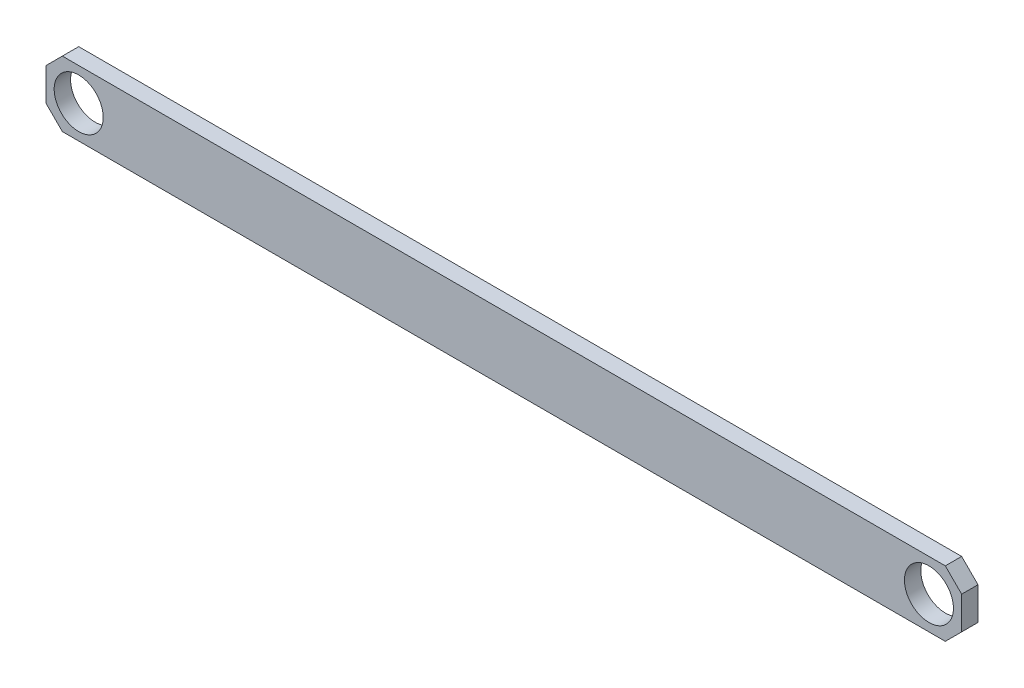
from build123d import *

# Parameters (mm, degrees)
SKETCH1_W          = 177.8
SKETCH1_H          = 12.7
SKETCH1_R          = 4.7625
BASE_EXTRUDE_DEPTH = 3.175
CHAMFER1_SIZE      = 3.175


with BuildPart() as part:
    # Sketch1 → Base-Extrude (new body)
    with BuildSketch(Plane.XY):
        with Locations((88.9, 6.35)):
            Rectangle(SKETCH1_W, SKETCH1_H)
        with Locations((6.35, 6.35)):
            Circle(SKETCH1_R, mode=Mode.SUBTRACT)
        with Locations(Location((171.45, 6.35, 0), (0, 0, 180))):
            Circle(SKETCH1_R, mode=Mode.SUBTRACT)
    extrude(amount=BASE_EXTRUDE_DEPTH)

    # Chamfer1
    chamfer1_edges = [part.edges().sort_by_distance(p)[0] for p in [
        (0, 12.7, 1.5875),
        (177.8, 12.7, 1.5875),
        (177.8, 0, 1.5875),
        (0, 0, 1.5875),
    ]]
    chamfer(chamfer1_edges, length=CHAMFER1_SIZE)


solid = part.part
